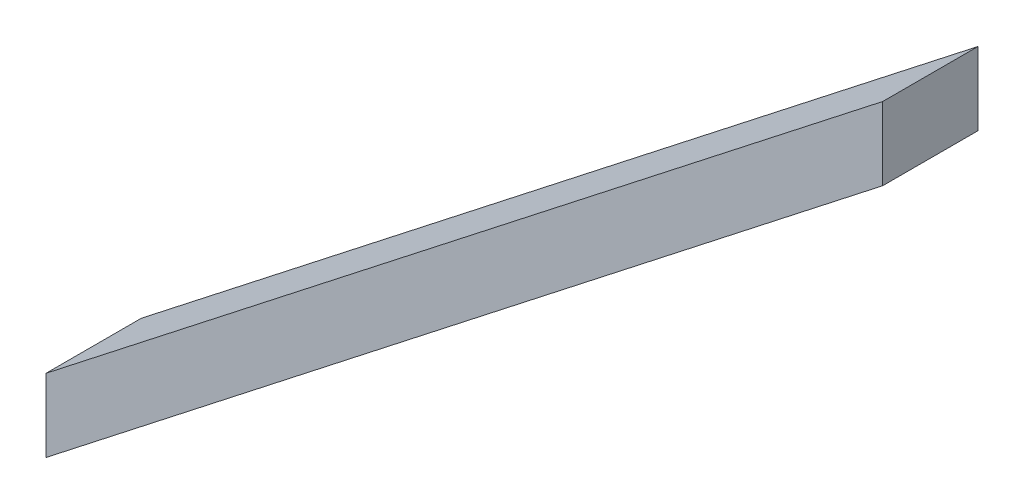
from build123d import *

# Parameters (mm, degrees)
BOSS_EXTRUDE1_DEPTH = 63


with BuildPart() as part:
    # Sketch1 → Boss-Extrude1 (new body)
    with BuildSketch(Plane.XY):
        Polygon((0, 0), (0, 48.222692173), (553, 480.273643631), (553, 432.050951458), align=None)
    extrude(amount=BOSS_EXTRUDE1_DEPTH)


solid = part.part
